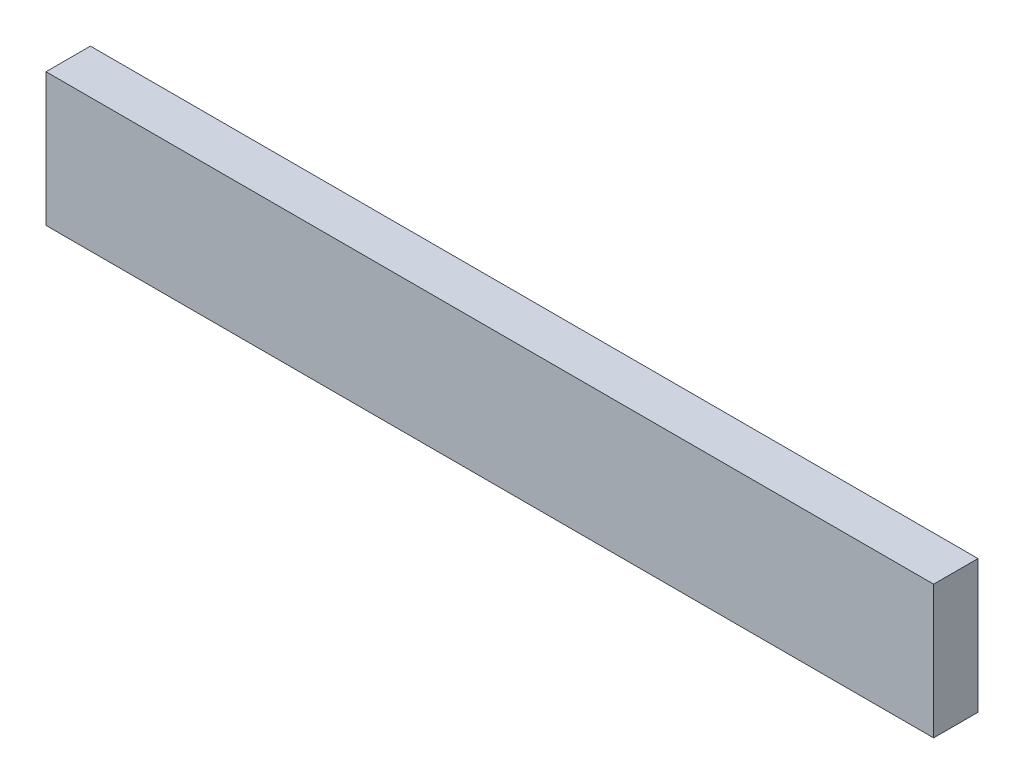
from build123d import *

# Parameters (mm, degrees)
SKETCH1_W          = 200
SKETCH1_H          = 30
BASE_EXTRUDE_DEPTH = 10


with BuildPart() as part:
    # Sketch1 → Base-Extrude (new body)
    with BuildSketch(Plane.XY):
        with Locations((100, 15)):
            Rectangle(SKETCH1_W, SKETCH1_H)
    extrude(amount=BASE_EXTRUDE_DEPTH)


solid = part.part
